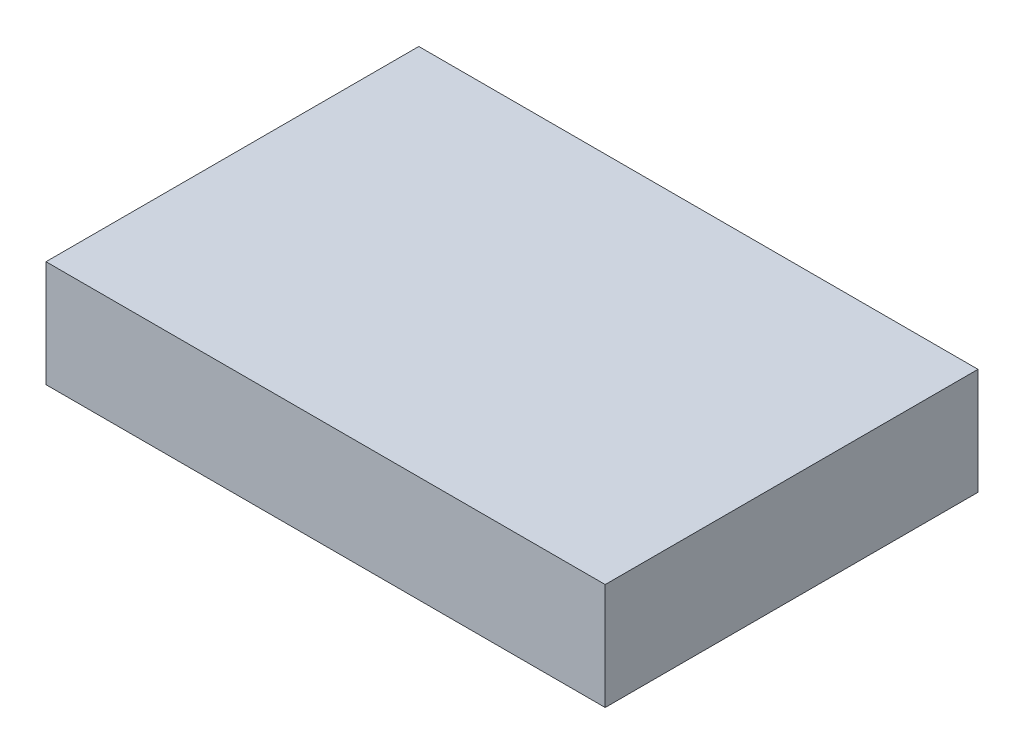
ISO-10303-21;
HEADER;
FILE_DESCRIPTION(('STEP AP214'),'2;1');
FILE_NAME('part.step','',(''),(''),'','','');
FILE_SCHEMA(('AUTOMOTIVE_DESIGN { 1 0 10303 214 1 1 1 1 }'));
ENDSEC;
DATA;
#1=APPLICATION_CONTEXT('core data for automotive mechanical design processes');
#2=APPLICATION_PROTOCOL_DEFINITION('international standard','automotive_design',2000,#1);
#3=PRODUCT_CONTEXT('',#1,'mechanical');
#4=PRODUCT('Part','Part','',(#3));
#5=PRODUCT_RELATED_PRODUCT_CATEGORY('part','',(#4));
#6=PRODUCT_DEFINITION_FORMATION('','',#4);
#7=PRODUCT_DEFINITION_CONTEXT('part definition',#1,'design');
#8=PRODUCT_DEFINITION('design','',#6,#7);
#9=PRODUCT_DEFINITION_SHAPE('','',#8);
#10=(LENGTH_UNIT() NAMED_UNIT(*) SI_UNIT(.MILLI.,.METRE.));
#11=(NAMED_UNIT(*) PLANE_ANGLE_UNIT() SI_UNIT($,.RADIAN.));
#12=(NAMED_UNIT(*) SI_UNIT($,.STERADIAN.) SOLID_ANGLE_UNIT());
#13=UNCERTAINTY_MEASURE_WITH_UNIT(LENGTH_MEASURE(1.E-05),#10,'distance_accuracy_value','');
#14=(GEOMETRIC_REPRESENTATION_CONTEXT(3) GLOBAL_UNCERTAINTY_ASSIGNED_CONTEXT((#13)) GLOBAL_UNIT_ASSIGNED_CONTEXT((#10,
#11,#12)) REPRESENTATION_CONTEXT('',''));
#15=CARTESIAN_POINT('',(0.,0.,0.));
#16=DIRECTION('',(0.,0.,1.));
#17=DIRECTION('',(1.,0.,0.));
#18=AXIS2_PLACEMENT_3D('',#15,#16,#17);
#19=CARTESIAN_POINT('',(63.,24.,-42.));
#20=DIRECTION('',(-1.,0.,0.));
#21=DIRECTION('',(0.,0.,1.));
#22=AXIS2_PLACEMENT_3D('',#19,#20,#21);
#23=PLANE('',#22);
#24=DIRECTION('',(0.,0.,-1.));
#25=VECTOR('',#24,1.);
#26=CARTESIAN_POINT('',(63.,0.,-42.));
#27=LINE('',#26,#25);
#28=CARTESIAN_POINT('',(63.,0.,42.));
#29=VERTEX_POINT('',#28);
#30=CARTESIAN_POINT('',(63.,0.,-42.));
#31=VERTEX_POINT('',#30);
#32=EDGE_CURVE('E100',#29,#31,#27,.T.);
#33=ORIENTED_EDGE('',*,*,#32,.T.);
#34=DIRECTION('',(0.,-1.,0.));
#35=VECTOR('',#34,1.);
#36=CARTESIAN_POINT('',(63.,24.,-42.));
#37=LINE('',#36,#35);
#38=CARTESIAN_POINT('',(63.,24.,-42.));
#39=VERTEX_POINT('',#38);
#40=EDGE_CURVE('E11',#39,#31,#37,.T.);
#41=ORIENTED_EDGE('',*,*,#40,.F.);
#42=DIRECTION('',(0.,0.,-1.));
#43=VECTOR('',#42,1.);
#44=CARTESIAN_POINT('',(63.,24.,-42.));
#45=LINE('',#44,#43);
#46=CARTESIAN_POINT('',(63.,24.,42.));
#47=VERTEX_POINT('',#46);
#48=EDGE_CURVE('E88',#47,#39,#45,.T.);
#49=ORIENTED_EDGE('',*,*,#48,.F.);
#50=DIRECTION('',(0.,-1.,0.));
#51=VECTOR('',#50,1.);
#52=CARTESIAN_POINT('',(63.,24.,42.));
#53=LINE('',#52,#51);
#54=EDGE_CURVE('E96',#47,#29,#53,.T.);
#55=ORIENTED_EDGE('',*,*,#54,.T.);
#56=EDGE_LOOP('',(#33,#41,#49,#55));
#57=FACE_BOUND('',#56,.T.);
#58=ADVANCED_FACE('F37',(#57),#23,.F.);
#59=CARTESIAN_POINT('',(-63.,24.,-42.));
#60=DIRECTION('',(0.,0.,1.));
#61=DIRECTION('',(1.,0.,0.));
#62=AXIS2_PLACEMENT_3D('',#59,#60,#61);
#63=PLANE('',#62);
#64=DIRECTION('',(-1.,0.,0.));
#65=VECTOR('',#64,1.);
#66=CARTESIAN_POINT('',(-63.,0.,-42.));
#67=LINE('',#66,#65);
#68=CARTESIAN_POINT('',(-63.,0.,-42.));
#69=VERTEX_POINT('',#68);
#70=EDGE_CURVE('E92',#31,#69,#67,.T.);
#71=ORIENTED_EDGE('',*,*,#70,.T.);
#72=DIRECTION('',(0.,-1.,0.));
#73=VECTOR('',#72,1.);
#74=CARTESIAN_POINT('',(-63.,24.,-42.));
#75=LINE('',#74,#73);
#76=CARTESIAN_POINT('',(-63.,24.,-42.));
#77=VERTEX_POINT('',#76);
#78=EDGE_CURVE('E45',#77,#69,#75,.T.);
#79=ORIENTED_EDGE('',*,*,#78,.F.);
#80=DIRECTION('',(-1.,0.,0.));
#81=VECTOR('',#80,1.);
#82=CARTESIAN_POINT('',(-63.,24.,-42.));
#83=LINE('',#82,#81);
#84=EDGE_CURVE('E83',#39,#77,#83,.T.);
#85=ORIENTED_EDGE('',*,*,#84,.F.);
#86=ORIENTED_EDGE('',*,*,#40,.T.);
#87=EDGE_LOOP('',(#71,#79,#85,#86));
#88=FACE_BOUND('',#87,.T.);
#89=ADVANCED_FACE('F91',(#88),#63,.F.);
#90=CARTESIAN_POINT('',(-63.,24.,-42.));
#91=DIRECTION('',(1.,0.,0.));
#92=DIRECTION('',(0.,0.,-1.));
#93=AXIS2_PLACEMENT_3D('',#90,#91,#92);
#94=PLANE('',#93);
#95=DIRECTION('',(0.,0.,1.));
#96=VECTOR('',#95,1.);
#97=CARTESIAN_POINT('',(-63.,0.,-42.));
#98=LINE('',#97,#96);
#99=CARTESIAN_POINT('',(-63.,0.,42.));
#100=VERTEX_POINT('',#99);
#101=EDGE_CURVE('E70',#69,#100,#98,.T.);
#102=ORIENTED_EDGE('',*,*,#101,.T.);
#103=DIRECTION('',(0.,-1.,0.));
#104=VECTOR('',#103,1.);
#105=CARTESIAN_POINT('',(-63.,24.,42.));
#106=LINE('',#105,#104);
#107=CARTESIAN_POINT('',(-63.,24.,42.));
#108=VERTEX_POINT('',#107);
#109=EDGE_CURVE('E93',#108,#100,#106,.T.);
#110=ORIENTED_EDGE('',*,*,#109,.F.);
#111=DIRECTION('',(0.,0.,1.));
#112=VECTOR('',#111,1.);
#113=CARTESIAN_POINT('',(-63.,24.,-42.));
#114=LINE('',#113,#112);
#115=EDGE_CURVE('E86',#77,#108,#114,.T.);
#116=ORIENTED_EDGE('',*,*,#115,.F.);
#117=ORIENTED_EDGE('',*,*,#78,.T.);
#118=EDGE_LOOP('',(#102,#110,#116,#117));
#119=FACE_BOUND('',#118,.T.);
#120=ADVANCED_FACE('F94',(#119),#94,.F.);
#121=CARTESIAN_POINT('',(-63.,24.,42.));
#122=DIRECTION('',(0.,0.,-1.));
#123=DIRECTION('',(-1.,0.,0.));
#124=AXIS2_PLACEMENT_3D('',#121,#122,#123);
#125=PLANE('',#124);
#126=DIRECTION('',(1.,0.,0.));
#127=VECTOR('',#126,1.);
#128=CARTESIAN_POINT('',(-63.,0.,42.));
#129=LINE('',#128,#127);
#130=EDGE_CURVE('E76',#100,#29,#129,.T.);
#131=ORIENTED_EDGE('',*,*,#130,.T.);
#132=ORIENTED_EDGE('',*,*,#54,.F.);
#133=DIRECTION('',(1.,0.,0.));
#134=VECTOR('',#133,1.);
#135=CARTESIAN_POINT('',(-63.,24.,42.));
#136=LINE('',#135,#134);
#137=EDGE_CURVE('E53',#108,#47,#136,.T.);
#138=ORIENTED_EDGE('',*,*,#137,.F.);
#139=ORIENTED_EDGE('',*,*,#109,.T.);
#140=EDGE_LOOP('',(#131,#132,#138,#139));
#141=FACE_BOUND('',#140,.T.);
#142=ADVANCED_FACE('F107',(#141),#125,.F.);
#143=CARTESIAN_POINT('',(0.,24.,0.));
#144=DIRECTION('',(0.,1.,0.));
#145=DIRECTION('',(0.,0.,1.));
#146=AXIS2_PLACEMENT_3D('',#143,#144,#145);
#147=PLANE('',#146);
#148=ORIENTED_EDGE('',*,*,#48,.T.);
#149=ORIENTED_EDGE('',*,*,#84,.T.);
#150=ORIENTED_EDGE('',*,*,#115,.T.);
#151=ORIENTED_EDGE('',*,*,#137,.T.);
#152=EDGE_LOOP('',(#148,#149,#150,#151));
#153=FACE_BOUND('',#152,.T.);
#154=ADVANCED_FACE('F84',(#153),#147,.T.);
#155=CARTESIAN_POINT('',(0.,0.,0.));
#156=DIRECTION('',(0.,1.,0.));
#157=DIRECTION('',(0.,0.,1.));
#158=AXIS2_PLACEMENT_3D('',#155,#156,#157);
#159=PLANE('',#158);
#160=ORIENTED_EDGE('',*,*,#32,.F.);
#161=ORIENTED_EDGE('',*,*,#130,.F.);
#162=ORIENTED_EDGE('',*,*,#101,.F.);
#163=ORIENTED_EDGE('',*,*,#70,.F.);
#164=EDGE_LOOP('',(#160,#161,#162,#163));
#165=FACE_BOUND('',#164,.T.);
#166=ADVANCED_FACE('F110',(#165),#159,.F.);
#167=CLOSED_SHELL('',(#58,#89,#120,#142,#154,#166));
#168=MANIFOLD_SOLID_BREP('B2',#167);
#169=ADVANCED_BREP_SHAPE_REPRESENTATION('',(#18,#168),#14);
#170=SHAPE_DEFINITION_REPRESENTATION(#9,#169);
ENDSEC;
END-ISO-10303-21;
